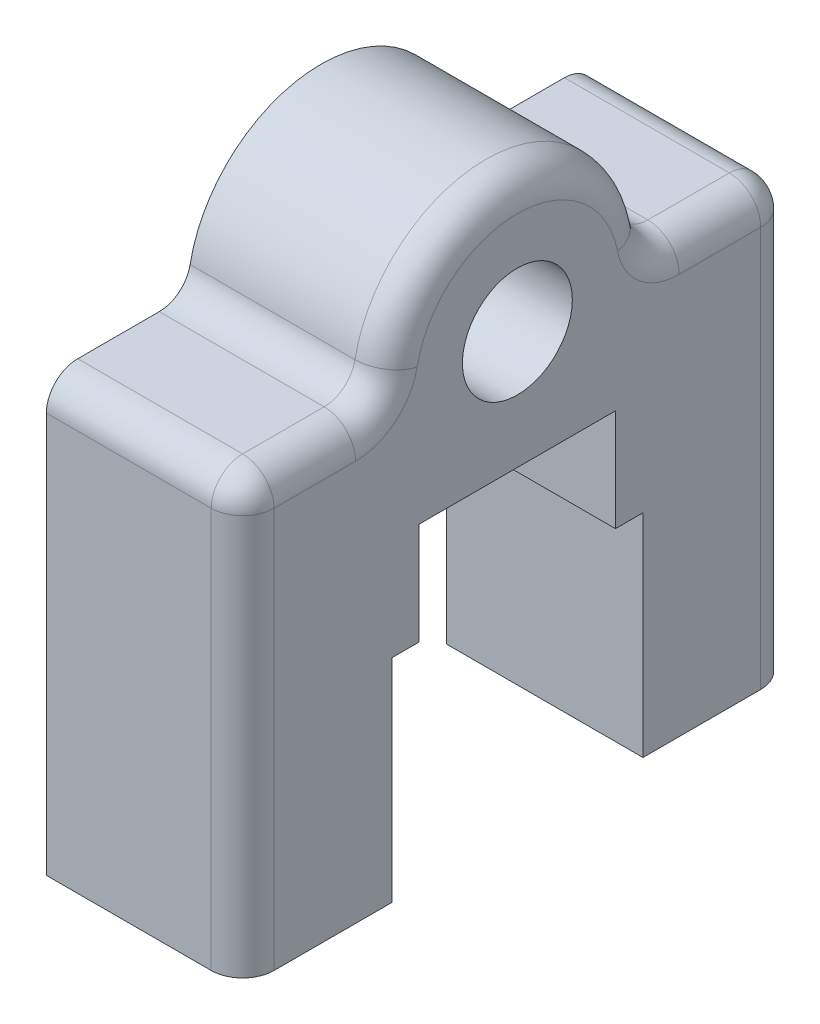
ISO-10303-21;
HEADER;
FILE_DESCRIPTION(('STEP AP214'),'2;1');
FILE_NAME('part.step','',(''),(''),'','','');
FILE_SCHEMA(('AUTOMOTIVE_DESIGN { 1 0 10303 214 1 1 1 1 }'));
ENDSEC;
DATA;
#1=APPLICATION_CONTEXT('core data for automotive mechanical design processes');
#2=APPLICATION_PROTOCOL_DEFINITION('international standard','automotive_design',2000,#1);
#3=PRODUCT_CONTEXT('',#1,'mechanical');
#4=PRODUCT('Part','Part','',(#3));
#5=PRODUCT_RELATED_PRODUCT_CATEGORY('part','',(#4));
#6=PRODUCT_DEFINITION_FORMATION('','',#4);
#7=PRODUCT_DEFINITION_CONTEXT('part definition',#1,'design');
#8=PRODUCT_DEFINITION('design','',#6,#7);
#9=PRODUCT_DEFINITION_SHAPE('','',#8);
#10=(LENGTH_UNIT() NAMED_UNIT(*) SI_UNIT(.MILLI.,.METRE.));
#11=(NAMED_UNIT(*) PLANE_ANGLE_UNIT() SI_UNIT($,.RADIAN.));
#12=(NAMED_UNIT(*) SI_UNIT($,.STERADIAN.) SOLID_ANGLE_UNIT());
#13=UNCERTAINTY_MEASURE_WITH_UNIT(LENGTH_MEASURE(1.E-05),#10,'distance_accuracy_value','');
#14=(GEOMETRIC_REPRESENTATION_CONTEXT(3) GLOBAL_UNCERTAINTY_ASSIGNED_CONTEXT((#13)) GLOBAL_UNIT_ASSIGNED_CONTEXT((#10,
#11,#12)) REPRESENTATION_CONTEXT('',''));
#15=CARTESIAN_POINT('',(0.,0.,0.));
#16=DIRECTION('',(0.,0.,1.));
#17=DIRECTION('',(1.,0.,0.));
#18=AXIS2_PLACEMENT_3D('',#15,#16,#17);
#19=CARTESIAN_POINT('',(25.,0.,35.));
#20=DIRECTION('',(0.,1.,0.));
#21=DIRECTION('',(0.,0.,1.));
#22=AXIS2_PLACEMENT_3D('',#19,#20,#21);
#23=PLANE('',#22);
#24=DIRECTION('',(0.,0.,-1.));
#25=VECTOR('',#24,1.);
#26=CARTESIAN_POINT('',(25.,0.,35.));
#27=LINE('',#26,#25);
#28=CARTESIAN_POINT('',(25.,0.,31.));
#29=VERTEX_POINT('',#28);
#30=CARTESIAN_POINT('',(25.,0.,16.));
#31=VERTEX_POINT('',#30);
#32=EDGE_CURVE('E236',#29,#31,#27,.T.);
#33=ORIENTED_EDGE('',*,*,#32,.F.);
#34=CARTESIAN_POINT('',(21.,0.,31.));
#35=DIRECTION('',(0.,1.,0.));
#36=DIRECTION('',(0.,0.,1.));
#37=AXIS2_PLACEMENT_3D('',#34,#35,#36);
#38=CIRCLE('',#37,4.);
#39=CARTESIAN_POINT('',(21.,0.,35.));
#40=VERTEX_POINT('',#39);
#41=EDGE_CURVE('E280',#29,#40,#38,.F.);
#42=ORIENTED_EDGE('',*,*,#41,.T.);
#43=DIRECTION('',(-1.,0.,0.));
#44=VECTOR('',#43,1.);
#45=CARTESIAN_POINT('',(25.,0.,35.));
#46=LINE('',#45,#44);
#47=CARTESIAN_POINT('',(0.,0.,35.));
#48=VERTEX_POINT('',#47);
#49=EDGE_CURVE('E212',#40,#48,#46,.T.);
#50=ORIENTED_EDGE('',*,*,#49,.T.);
#51=DIRECTION('',(0.,0.,-1.));
#52=VECTOR('',#51,1.);
#53=CARTESIAN_POINT('',(0.,0.,35.));
#54=LINE('',#53,#52);
#55=CARTESIAN_POINT('',(0.,0.,16.));
#56=VERTEX_POINT('',#55);
#57=EDGE_CURVE('E205',#48,#56,#54,.T.);
#58=ORIENTED_EDGE('',*,*,#57,.T.);
#59=DIRECTION('',(1.,0.,0.));
#60=VECTOR('',#59,1.);
#61=CARTESIAN_POINT('',(0.,0.,16.));
#62=LINE('',#61,#60);
#63=EDGE_CURVE('E186',#56,#31,#62,.T.);
#64=ORIENTED_EDGE('',*,*,#63,.T.);
#65=EDGE_LOOP('',(#33,#42,#50,#58,#64));
#66=FACE_BOUND('',#65,.T.);
#67=ADVANCED_FACE('F34',(#66),#23,.F.);
#68=CARTESIAN_POINT('',(25.,55.,0.));
#69=DIRECTION('',(1.,0.,0.));
#70=DIRECTION('',(0.,0.,-1.));
#71=AXIS2_PLACEMENT_3D('',#68,#69,#70);
#72=PLANE('',#71);
#73=DIRECTION('',(0.,0.,1.));
#74=VECTOR('',#73,1.);
#75=CARTESIAN_POINT('',(25.,51.,31.));
#76=LINE('',#75,#74);
#77=CARTESIAN_POINT('',(25.,51.,20.6155281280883));
#78=VERTEX_POINT('',#77);
#79=CARTESIAN_POINT('',(25.,51.,31.));
#80=VERTEX_POINT('',#79);
#81=EDGE_CURVE('E275',#78,#80,#76,.T.);
#82=ORIENTED_EDGE('',*,*,#81,.T.);
#83=DIRECTION('',(0.,-1.,0.));
#84=VECTOR('',#83,1.);
#85=CARTESIAN_POINT('',(25.,0.,31.));
#86=LINE('',#85,#84);
#87=EDGE_CURVE('E277',#80,#29,#86,.T.);
#88=ORIENTED_EDGE('',*,*,#87,.T.);
#89=ORIENTED_EDGE('',*,*,#32,.T.);
#90=DIRECTION('',(0.,-1.,0.));
#91=VECTOR('',#90,1.);
#92=CARTESIAN_POINT('',(25.,27.,16.));
#93=LINE('',#92,#91);
#94=CARTESIAN_POINT('',(25.,27.,16.));
#95=VERTEX_POINT('',#94);
#96=EDGE_CURVE('E192',#95,#31,#93,.T.);
#97=ORIENTED_EDGE('',*,*,#96,.F.);
#98=DIRECTION('',(0.,0.,1.));
#99=VECTOR('',#98,1.);
#100=CARTESIAN_POINT('',(25.,27.,16.));
#101=LINE('',#100,#99);
#102=CARTESIAN_POINT('',(25.,27.,12.5));
#103=VERTEX_POINT('',#102);
#104=EDGE_CURVE('E209',#103,#95,#101,.T.);
#105=ORIENTED_EDGE('',*,*,#104,.F.);
#106=DIRECTION('',(0.,-1.,0.));
#107=VECTOR('',#106,1.);
#108=CARTESIAN_POINT('',(25.,27.,12.5));
#109=LINE('',#108,#107);
#110=CARTESIAN_POINT('',(25.,40.,12.5));
#111=VERTEX_POINT('',#110);
#112=EDGE_CURVE('E340',#111,#103,#109,.T.);
#113=ORIENTED_EDGE('',*,*,#112,.F.);
#114=DIRECTION('',(0.,0.,1.));
#115=VECTOR('',#114,1.);
#116=CARTESIAN_POINT('',(25.,40.,12.5));
#117=LINE('',#116,#115);
#118=CARTESIAN_POINT('',(25.,40.,-12.5));
#119=VERTEX_POINT('',#118);
#120=EDGE_CURVE('E337',#119,#111,#117,.T.);
#121=ORIENTED_EDGE('',*,*,#120,.F.);
#122=DIRECTION('',(0.,1.,0.));
#123=VECTOR('',#122,1.);
#124=CARTESIAN_POINT('',(25.,27.,-12.5));
#125=LINE('',#124,#123);
#126=CARTESIAN_POINT('',(25.,27.,-12.5));
#127=VERTEX_POINT('',#126);
#128=EDGE_CURVE('E334',#127,#119,#125,.T.);
#129=ORIENTED_EDGE('',*,*,#128,.F.);
#130=DIRECTION('',(0.,0.,1.));
#131=VECTOR('',#130,1.);
#132=CARTESIAN_POINT('',(25.,27.,-12.5));
#133=LINE('',#132,#131);
#134=CARTESIAN_POINT('',(25.,27.,-16.));
#135=VERTEX_POINT('',#134);
#136=EDGE_CURVE('E327',#135,#127,#133,.T.);
#137=ORIENTED_EDGE('',*,*,#136,.F.);
#138=DIRECTION('',(0.,1.,0.));
#139=VECTOR('',#138,1.);
#140=CARTESIAN_POINT('',(25.,27.,-16.));
#141=LINE('',#140,#139);
#142=CARTESIAN_POINT('',(25.,0.,-16.));
#143=VERTEX_POINT('',#142);
#144=EDGE_CURVE('E324',#143,#135,#141,.T.);
#145=ORIENTED_EDGE('',*,*,#144,.F.);
#146=CARTESIAN_POINT('',(25.,0.,-31.));
#147=VERTEX_POINT('',#146);
#148=EDGE_CURVE('E233',#143,#147,#27,.T.);
#149=ORIENTED_EDGE('',*,*,#148,.T.);
#150=DIRECTION('',(0.,1.,0.));
#151=VECTOR('',#150,1.);
#152=CARTESIAN_POINT('',(25.,51.,-31.));
#153=LINE('',#152,#151);
#154=CARTESIAN_POINT('',(25.,51.,-31.));
#155=VERTEX_POINT('',#154);
#156=EDGE_CURVE('E265',#147,#155,#153,.T.);
#157=ORIENTED_EDGE('',*,*,#156,.T.);
#158=DIRECTION('',(0.,0.,1.));
#159=VECTOR('',#158,1.);
#160=CARTESIAN_POINT('',(25.,51.,-20.6155281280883));
#161=LINE('',#160,#159);
#162=CARTESIAN_POINT('',(25.,51.,-20.6155281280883));
#163=VERTEX_POINT('',#162);
#164=EDGE_CURVE('E267',#155,#163,#161,.T.);
#165=ORIENTED_EDGE('',*,*,#164,.T.);
#166=CARTESIAN_POINT('',(25.,59.,-20.6155281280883));
#167=DIRECTION('',(1.,0.,0.));
#168=DIRECTION('',(0.,0.,-1.));
#169=AXIS2_PLACEMENT_3D('',#166,#167,#168);
#170=CIRCLE('',#169,8.);
#171=CARTESIAN_POINT('',(25.,57.4761904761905,-12.7619936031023));
#172=VERTEX_POINT('',#171);
#173=EDGE_CURVE('E269',#163,#172,#170,.F.);
#174=ORIENTED_EDGE('',*,*,#173,.T.);
#175=CARTESIAN_POINT('',(25.,55.,0.));
#176=DIRECTION('',(1.,0.,0.));
#177=DIRECTION('',(0.,0.,-1.));
#178=AXIS2_PLACEMENT_3D('',#175,#176,#177);
#179=CIRCLE('',#178,13.);
#180=CARTESIAN_POINT('',(25.,57.4761904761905,12.7619936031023));
#181=VERTEX_POINT('',#180);
#182=EDGE_CURVE('E271',#172,#181,#179,.T.);
#183=ORIENTED_EDGE('',*,*,#182,.T.);
#184=CARTESIAN_POINT('',(25.,59.,20.6155281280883));
#185=DIRECTION('',(1.,0.,0.));
#186=DIRECTION('',(0.,0.,-1.));
#187=AXIS2_PLACEMENT_3D('',#184,#185,#186);
#188=CIRCLE('',#187,8.);
#189=EDGE_CURVE('E273',#181,#78,#188,.F.);
#190=ORIENTED_EDGE('',*,*,#189,.T.);
#191=EDGE_LOOP('',(#82,#88,#89,#97,#105,#113,#121,#129,#137,#145,#149,#157,#165,#174,#183,#190));
#192=FACE_BOUND('',#191,.T.);
#193=CARTESIAN_POINT('',(25.,55.,0.));
#194=DIRECTION('',(1.,0.,0.));
#195=DIRECTION('',(0.,0.,-1.));
#196=AXIS2_PLACEMENT_3D('',#193,#194,#195);
#197=CIRCLE('',#196,7.);
#198=CARTESIAN_POINT('',(25.,55.,-7.));
#199=VERTEX_POINT('',#198);
#200=EDGE_CURVE('E359',#199,#199,#197,.T.);
#201=ORIENTED_EDGE('',*,*,#200,.F.);
#202=EDGE_LOOP('',(#201));
#203=FACE_BOUND('',#202,.T.);
#204=ADVANCED_FACE('F368',(#192,#203),#72,.T.);
#205=CARTESIAN_POINT('',(0.,55.,0.));
#206=DIRECTION('',(1.,0.,0.));
#207=DIRECTION('',(0.,0.,-1.));
#208=AXIS2_PLACEMENT_3D('',#205,#206,#207);
#209=PLANE('',#208);
#210=DIRECTION('',(0.,0.,1.));
#211=VECTOR('',#210,1.);
#212=CARTESIAN_POINT('',(0.,55.,-17.));
#213=LINE('',#212,#211);
#214=CARTESIAN_POINT('',(0.,55.,-31.));
#215=VERTEX_POINT('',#214);
#216=CARTESIAN_POINT('',(0.,55.,-20.6155281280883));
#217=VERTEX_POINT('',#216);
#218=EDGE_CURVE('E218',#215,#217,#213,.T.);
#219=ORIENTED_EDGE('',*,*,#218,.F.);
#220=CARTESIAN_POINT('',(0.,51.,-31.));
#221=DIRECTION('',(1.,0.,0.));
#222=DIRECTION('',(0.,0.,-1.));
#223=AXIS2_PLACEMENT_3D('',#220,#221,#222);
#224=CIRCLE('',#223,4.);
#225=CARTESIAN_POINT('',(0.,51.,-35.));
#226=VERTEX_POINT('',#225);
#227=EDGE_CURVE('E245',#215,#226,#224,.F.);
#228=ORIENTED_EDGE('',*,*,#227,.T.);
#229=DIRECTION('',(0.,1.,0.));
#230=VECTOR('',#229,1.);
#231=CARTESIAN_POINT('',(0.,0.,-35.));
#232=LINE('',#231,#230);
#233=CARTESIAN_POINT('',(0.,0.,-35.));
#234=VERTEX_POINT('',#233);
#235=EDGE_CURVE('E214',#234,#226,#232,.T.);
#236=ORIENTED_EDGE('',*,*,#235,.F.);
#237=CARTESIAN_POINT('',(0.,0.,-16.));
#238=VERTEX_POINT('',#237);
#239=EDGE_CURVE('E215',#238,#234,#54,.T.);
#240=ORIENTED_EDGE('',*,*,#239,.F.);
#241=DIRECTION('',(0.,1.,0.));
#242=VECTOR('',#241,1.);
#243=CARTESIAN_POINT('',(0.,27.,-16.));
#244=LINE('',#243,#242);
#245=CARTESIAN_POINT('',(0.,27.,-16.));
#246=VERTEX_POINT('',#245);
#247=EDGE_CURVE('E208',#238,#246,#244,.T.);
#248=ORIENTED_EDGE('',*,*,#247,.T.);
#249=DIRECTION('',(0.,0.,1.));
#250=VECTOR('',#249,1.);
#251=CARTESIAN_POINT('',(0.,27.,-12.5));
#252=LINE('',#251,#250);
#253=CARTESIAN_POINT('',(0.,27.,-12.5));
#254=VERTEX_POINT('',#253);
#255=EDGE_CURVE('E513',#246,#254,#252,.T.);
#256=ORIENTED_EDGE('',*,*,#255,.T.);
#257=DIRECTION('',(0.,1.,0.));
#258=VECTOR('',#257,1.);
#259=CARTESIAN_POINT('',(0.,27.,-12.5));
#260=LINE('',#259,#258);
#261=CARTESIAN_POINT('',(0.,40.,-12.5));
#262=VERTEX_POINT('',#261);
#263=EDGE_CURVE('E516',#254,#262,#260,.T.);
#264=ORIENTED_EDGE('',*,*,#263,.T.);
#265=DIRECTION('',(0.,0.,1.));
#266=VECTOR('',#265,1.);
#267=CARTESIAN_POINT('',(0.,40.,12.5));
#268=LINE('',#267,#266);
#269=CARTESIAN_POINT('',(0.,40.,12.5));
#270=VERTEX_POINT('',#269);
#271=EDGE_CURVE('E508',#262,#270,#268,.T.);
#272=ORIENTED_EDGE('',*,*,#271,.T.);
#273=DIRECTION('',(0.,-1.,0.));
#274=VECTOR('',#273,1.);
#275=CARTESIAN_POINT('',(0.,27.,12.5));
#276=LINE('',#275,#274);
#277=CARTESIAN_POINT('',(0.,27.,12.5));
#278=VERTEX_POINT('',#277);
#279=EDGE_CURVE('E505',#270,#278,#276,.T.);
#280=ORIENTED_EDGE('',*,*,#279,.T.);
#281=DIRECTION('',(0.,0.,1.));
#282=VECTOR('',#281,1.);
#283=CARTESIAN_POINT('',(0.,27.,16.));
#284=LINE('',#283,#282);
#285=CARTESIAN_POINT('',(0.,27.,16.));
#286=VERTEX_POINT('',#285);
#287=EDGE_CURVE('E197',#278,#286,#284,.T.);
#288=ORIENTED_EDGE('',*,*,#287,.T.);
#289=DIRECTION('',(0.,-1.,0.));
#290=VECTOR('',#289,1.);
#291=CARTESIAN_POINT('',(0.,27.,16.));
#292=LINE('',#291,#290);
#293=EDGE_CURVE('E189',#286,#56,#292,.T.);
#294=ORIENTED_EDGE('',*,*,#293,.T.);
#295=ORIENTED_EDGE('',*,*,#57,.F.);
#296=DIRECTION('',(0.,-1.,0.));
#297=VECTOR('',#296,1.);
#298=CARTESIAN_POINT('',(0.,0.,35.));
#299=LINE('',#298,#297);
#300=CARTESIAN_POINT('',(0.,51.,35.));
#301=VERTEX_POINT('',#300);
#302=EDGE_CURVE('E221',#301,#48,#299,.T.);
#303=ORIENTED_EDGE('',*,*,#302,.F.);
#304=CARTESIAN_POINT('',(0.,51.,31.));
#305=DIRECTION('',(1.,0.,0.));
#306=DIRECTION('',(0.,0.,-1.));
#307=AXIS2_PLACEMENT_3D('',#304,#305,#306);
#308=CIRCLE('',#307,4.);
#309=CARTESIAN_POINT('',(0.,55.,31.));
#310=VERTEX_POINT('',#309);
#311=EDGE_CURVE('E243',#301,#310,#308,.F.);
#312=ORIENTED_EDGE('',*,*,#311,.T.);
#313=DIRECTION('',(0.,0.,1.));
#314=VECTOR('',#313,1.);
#315=CARTESIAN_POINT('',(0.,55.,35.));
#316=LINE('',#315,#314);
#317=CARTESIAN_POINT('',(0.,55.,20.6155281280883));
#318=VERTEX_POINT('',#317);
#319=EDGE_CURVE('E230',#318,#310,#316,.T.);
#320=ORIENTED_EDGE('',*,*,#319,.F.);
#321=CARTESIAN_POINT('',(0.,59.,20.6155281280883));
#322=DIRECTION('',(1.,0.,0.));
#323=DIRECTION('',(0.,0.,-1.));
#324=AXIS2_PLACEMENT_3D('',#321,#322,#323);
#325=CIRCLE('',#324,4.);
#326=CARTESIAN_POINT('',(0.,58.2380952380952,16.6887608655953));
#327=VERTEX_POINT('',#326);
#328=EDGE_CURVE('E263',#318,#327,#325,.T.);
#329=ORIENTED_EDGE('',*,*,#328,.T.);
#330=CARTESIAN_POINT('',(0.,55.,0.));
#331=DIRECTION('',(1.,0.,0.));
#332=DIRECTION('',(0.,0.,-1.));
#333=AXIS2_PLACEMENT_3D('',#330,#331,#332);
#334=CIRCLE('',#333,17.);
#335=CARTESIAN_POINT('',(0.,58.2380952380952,-16.6887608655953));
#336=VERTEX_POINT('',#335);
#337=EDGE_CURVE('E227',#336,#327,#334,.T.);
#338=ORIENTED_EDGE('',*,*,#337,.F.);
#339=CARTESIAN_POINT('',(0.,59.,-20.6155281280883));
#340=DIRECTION('',(1.,0.,0.));
#341=DIRECTION('',(0.,0.,-1.));
#342=AXIS2_PLACEMENT_3D('',#339,#340,#341);
#343=CIRCLE('',#342,4.);
#344=EDGE_CURVE('E261',#336,#217,#343,.T.);
#345=ORIENTED_EDGE('',*,*,#344,.T.);
#346=EDGE_LOOP('',(#219,#228,#236,#240,#248,#256,#264,#272,#280,#288,#294,#295,#303,#312,#320,
#329,#338,#345));
#347=FACE_BOUND('',#346,.T.);
#348=CARTESIAN_POINT('',(0.,55.,0.));
#349=DIRECTION('',(1.,0.,0.));
#350=DIRECTION('',(0.,0.,-1.));
#351=AXIS2_PLACEMENT_3D('',#348,#349,#350);
#352=CIRCLE('',#351,7.);
#353=CARTESIAN_POINT('',(0.,55.,-7.));
#354=VERTEX_POINT('',#353);
#355=EDGE_CURVE('E347',#354,#354,#352,.T.);
#356=ORIENTED_EDGE('',*,*,#355,.T.);
#357=EDGE_LOOP('',(#356));
#358=FACE_BOUND('',#357,.T.);
#359=ADVANCED_FACE('F202',(#347,#358),#209,.F.);
#360=CARTESIAN_POINT('',(25.,0.,35.));
#361=DIRECTION('',(0.,0.,-1.));
#362=DIRECTION('',(-1.,0.,0.));
#363=AXIS2_PLACEMENT_3D('',#360,#361,#362);
#364=PLANE('',#363);
#365=ORIENTED_EDGE('',*,*,#49,.F.);
#366=DIRECTION('',(0.,-1.,0.));
#367=VECTOR('',#366,1.);
#368=CARTESIAN_POINT('',(21.,51.,35.));
#369=LINE('',#368,#367);
#370=CARTESIAN_POINT('',(21.,51.,35.));
#371=VERTEX_POINT('',#370);
#372=EDGE_CURVE('E282',#40,#371,#369,.F.);
#373=ORIENTED_EDGE('',*,*,#372,.T.);
#374=DIRECTION('',(-1.,0.,0.));
#375=VECTOR('',#374,1.);
#376=CARTESIAN_POINT('',(25.,51.,35.));
#377=LINE('',#376,#375);
#378=EDGE_CURVE('E259',#371,#301,#377,.T.);
#379=ORIENTED_EDGE('',*,*,#378,.T.);
#380=ORIENTED_EDGE('',*,*,#302,.T.);
#381=EDGE_LOOP('',(#365,#373,#379,#380));
#382=FACE_BOUND('',#381,.T.);
#383=ADVANCED_FACE('F407',(#382),#364,.F.);
#384=DIRECTION('',(-1.,0.,0.));
#385=VECTOR('',#384,1.);
#386=CARTESIAN_POINT('',(25.,0.,-35.));
#387=LINE('',#386,#385);
#388=CARTESIAN_POINT('',(21.,0.,-35.));
#389=VERTEX_POINT('',#388);
#390=EDGE_CURVE('E234',#389,#234,#387,.T.);
#391=ORIENTED_EDGE('',*,*,#390,.F.);
#392=CARTESIAN_POINT('',(21.,0.,-31.));
#393=DIRECTION('',(0.,1.,0.));
#394=DIRECTION('',(0.,0.,1.));
#395=AXIS2_PLACEMENT_3D('',#392,#393,#394);
#396=CIRCLE('',#395,4.);
#397=EDGE_CURVE('E11',#389,#147,#396,.F.);
#398=ORIENTED_EDGE('',*,*,#397,.T.);
#399=ORIENTED_EDGE('',*,*,#148,.F.);
#400=DIRECTION('',(1.,0.,0.));
#401=VECTOR('',#400,1.);
#402=CARTESIAN_POINT('',(0.,0.,-16.));
#403=LINE('',#402,#401);
#404=EDGE_CURVE('E196',#238,#143,#403,.T.);
#405=ORIENTED_EDGE('',*,*,#404,.F.);
#406=ORIENTED_EDGE('',*,*,#239,.T.);
#407=EDGE_LOOP('',(#391,#398,#399,#405,#406));
#408=FACE_BOUND('',#407,.T.);
#409=ADVANCED_FACE('F431',(#408),#23,.F.);
#410=CARTESIAN_POINT('',(25.,0.,-35.));
#411=DIRECTION('',(0.,0.,1.));
#412=DIRECTION('',(1.,0.,0.));
#413=AXIS2_PLACEMENT_3D('',#410,#411,#412);
#414=PLANE('',#413);
#415=DIRECTION('',(-1.,0.,0.));
#416=VECTOR('',#415,1.);
#417=CARTESIAN_POINT('',(25.,51.,-35.));
#418=LINE('',#417,#416);
#419=CARTESIAN_POINT('',(21.,51.,-35.));
#420=VERTEX_POINT('',#419);
#421=EDGE_CURVE('E247',#226,#420,#418,.F.);
#422=ORIENTED_EDGE('',*,*,#421,.T.);
#423=DIRECTION('',(0.,1.,0.));
#424=VECTOR('',#423,1.);
#425=CARTESIAN_POINT('',(21.,0.,-35.));
#426=LINE('',#425,#424);
#427=EDGE_CURVE('E43',#420,#389,#426,.F.);
#428=ORIENTED_EDGE('',*,*,#427,.T.);
#429=ORIENTED_EDGE('',*,*,#390,.T.);
#430=ORIENTED_EDGE('',*,*,#235,.T.);
#431=EDGE_LOOP('',(#422,#428,#429,#430));
#432=FACE_BOUND('',#431,.T.);
#433=ADVANCED_FACE('F439',(#432),#414,.F.);
#434=CARTESIAN_POINT('',(25.,55.,-17.));
#435=DIRECTION('',(0.,-1.,0.));
#436=DIRECTION('',(0.,0.,-1.));
#437=AXIS2_PLACEMENT_3D('',#434,#435,#436);
#438=PLANE('',#437);
#439=DIRECTION('',(1.,0.,0.));
#440=VECTOR('',#439,1.);
#441=CARTESIAN_POINT('',(25.,55.,-20.6155281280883));
#442=LINE('',#441,#440);
#443=CARTESIAN_POINT('',(21.,55.,-20.6155281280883));
#444=VERTEX_POINT('',#443);
#445=EDGE_CURVE('E238',#217,#444,#442,.T.);
#446=ORIENTED_EDGE('',*,*,#445,.T.);
#447=DIRECTION('',(0.,0.,1.));
#448=VECTOR('',#447,1.);
#449=CARTESIAN_POINT('',(21.,55.,-31.));
#450=LINE('',#449,#448);
#451=CARTESIAN_POINT('',(21.,55.,-31.));
#452=VERTEX_POINT('',#451);
#453=EDGE_CURVE('E294',#444,#452,#450,.F.);
#454=ORIENTED_EDGE('',*,*,#453,.T.);
#455=DIRECTION('',(-1.,0.,0.));
#456=VECTOR('',#455,1.);
#457=CARTESIAN_POINT('',(25.,55.,-31.));
#458=LINE('',#457,#456);
#459=EDGE_CURVE('E241',#452,#215,#458,.T.);
#460=ORIENTED_EDGE('',*,*,#459,.T.);
#461=ORIENTED_EDGE('',*,*,#218,.T.);
#462=EDGE_LOOP('',(#446,#454,#460,#461));
#463=FACE_BOUND('',#462,.T.);
#464=ADVANCED_FACE('F444',(#463),#438,.F.);
#465=CARTESIAN_POINT('',(25.,55.,0.));
#466=DIRECTION('',(-1.,0.,0.));
#467=DIRECTION('',(0.,0.,1.));
#468=AXIS2_PLACEMENT_3D('',#465,#466,#467);
#469=CYLINDRICAL_SURFACE('',#468,17.);
#470=DIRECTION('',(-1.,0.,0.));
#471=VECTOR('',#470,1.);
#472=CARTESIAN_POINT('',(25.,58.2380952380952,16.6887608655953));
#473=LINE('',#472,#471);
#474=CARTESIAN_POINT('',(21.,58.2380952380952,16.6887608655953));
#475=VERTEX_POINT('',#474);
#476=EDGE_CURVE('E249',#327,#475,#473,.F.);
#477=ORIENTED_EDGE('',*,*,#476,.T.);
#478=CARTESIAN_POINT('',(21.,55.,0.));
#479=DIRECTION('',(1.,0.,0.));
#480=DIRECTION('',(0.,0.,-1.));
#481=AXIS2_PLACEMENT_3D('',#478,#479,#480);
#482=CIRCLE('',#481,17.);
#483=CARTESIAN_POINT('',(21.,58.2380952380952,-16.6887608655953));
#484=VERTEX_POINT('',#483);
#485=EDGE_CURVE('E290',#475,#484,#482,.F.);
#486=ORIENTED_EDGE('',*,*,#485,.T.);
#487=DIRECTION('',(-1.,0.,0.));
#488=VECTOR('',#487,1.);
#489=CARTESIAN_POINT('',(25.,58.2380952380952,-16.6887608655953));
#490=LINE('',#489,#488);
#491=EDGE_CURVE('E252',#484,#336,#490,.T.);
#492=ORIENTED_EDGE('',*,*,#491,.T.);
#493=ORIENTED_EDGE('',*,*,#337,.T.);
#494=EDGE_LOOP('',(#477,#486,#492,#493));
#495=FACE_BOUND('',#494,.T.);
#496=ADVANCED_FACE('F456',(#495),#469,.T.);
#497=CARTESIAN_POINT('',(25.,55.,35.));
#498=DIRECTION('',(0.,-1.,0.));
#499=DIRECTION('',(0.,0.,-1.));
#500=AXIS2_PLACEMENT_3D('',#497,#498,#499);
#501=PLANE('',#500);
#502=DIRECTION('',(-1.,0.,0.));
#503=VECTOR('',#502,1.);
#504=CARTESIAN_POINT('',(25.,55.,31.));
#505=LINE('',#504,#503);
#506=CARTESIAN_POINT('',(21.,55.,31.));
#507=VERTEX_POINT('',#506);
#508=EDGE_CURVE('E254',#310,#507,#505,.F.);
#509=ORIENTED_EDGE('',*,*,#508,.T.);
#510=DIRECTION('',(0.,0.,1.));
#511=VECTOR('',#510,1.);
#512=CARTESIAN_POINT('',(21.,55.,20.6155281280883));
#513=LINE('',#512,#511);
#514=CARTESIAN_POINT('',(21.,55.,20.6155281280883));
#515=VERTEX_POINT('',#514);
#516=EDGE_CURVE('E286',#507,#515,#513,.F.);
#517=ORIENTED_EDGE('',*,*,#516,.T.);
#518=DIRECTION('',(1.,0.,0.));
#519=VECTOR('',#518,1.);
#520=CARTESIAN_POINT('',(0.,55.,20.6155281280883));
#521=LINE('',#520,#519);
#522=EDGE_CURVE('E257',#515,#318,#521,.F.);
#523=ORIENTED_EDGE('',*,*,#522,.T.);
#524=ORIENTED_EDGE('',*,*,#319,.T.);
#525=EDGE_LOOP('',(#509,#517,#523,#524));
#526=FACE_BOUND('',#525,.T.);
#527=ADVANCED_FACE('F414',(#526),#501,.F.);
#528=CARTESIAN_POINT('',(25.,55.,0.));
#529=DIRECTION('',(-1.,0.,0.));
#530=DIRECTION('',(0.,0.,1.));
#531=AXIS2_PLACEMENT_3D('',#528,#529,#530);
#532=CYLINDRICAL_SURFACE('',#531,7.);
#533=ORIENTED_EDGE('',*,*,#200,.T.);
#534=EDGE_LOOP('',(#533));
#535=FACE_BOUND('',#534,.T.);
#536=ORIENTED_EDGE('',*,*,#355,.F.);
#537=EDGE_LOOP('',(#536));
#538=FACE_BOUND('',#537,.T.);
#539=ADVANCED_FACE('F464',(#535,#538),#532,.F.);
#540=CARTESIAN_POINT('',(0.,27.,16.));
#541=DIRECTION('',(0.,0.,1.));
#542=DIRECTION('',(1.,0.,0.));
#543=AXIS2_PLACEMENT_3D('',#540,#541,#542);
#544=PLANE('',#543);
#545=ORIENTED_EDGE('',*,*,#96,.T.);
#546=ORIENTED_EDGE('',*,*,#63,.F.);
#547=ORIENTED_EDGE('',*,*,#293,.F.);
#548=DIRECTION('',(1.,0.,0.));
#549=VECTOR('',#548,1.);
#550=CARTESIAN_POINT('',(0.,27.,16.));
#551=LINE('',#550,#549);
#552=EDGE_CURVE('E345',#286,#95,#551,.T.);
#553=ORIENTED_EDGE('',*,*,#552,.T.);
#554=EDGE_LOOP('',(#545,#546,#547,#553));
#555=FACE_BOUND('',#554,.T.);
#556=ADVANCED_FACE('F188',(#555),#544,.F.);
#557=CARTESIAN_POINT('',(0.,27.,16.));
#558=DIRECTION('',(0.,1.,0.));
#559=DIRECTION('',(0.,0.,1.));
#560=AXIS2_PLACEMENT_3D('',#557,#558,#559);
#561=PLANE('',#560);
#562=ORIENTED_EDGE('',*,*,#104,.T.);
#563=ORIENTED_EDGE('',*,*,#552,.F.);
#564=ORIENTED_EDGE('',*,*,#287,.F.);
#565=DIRECTION('',(1.,0.,0.));
#566=VECTOR('',#565,1.);
#567=CARTESIAN_POINT('',(0.,27.,12.5));
#568=LINE('',#567,#566);
#569=EDGE_CURVE('E348',#278,#103,#568,.T.);
#570=ORIENTED_EDGE('',*,*,#569,.T.);
#571=EDGE_LOOP('',(#562,#563,#564,#570));
#572=FACE_BOUND('',#571,.T.);
#573=ADVANCED_FACE('F475',(#572),#561,.F.);
#574=CARTESIAN_POINT('',(0.,27.,12.5));
#575=DIRECTION('',(0.,0.,1.));
#576=DIRECTION('',(1.,0.,0.));
#577=AXIS2_PLACEMENT_3D('',#574,#575,#576);
#578=PLANE('',#577);
#579=ORIENTED_EDGE('',*,*,#112,.T.);
#580=ORIENTED_EDGE('',*,*,#569,.F.);
#581=ORIENTED_EDGE('',*,*,#279,.F.);
#582=DIRECTION('',(1.,0.,0.));
#583=VECTOR('',#582,1.);
#584=CARTESIAN_POINT('',(0.,40.,12.5));
#585=LINE('',#584,#583);
#586=EDGE_CURVE('E350',#270,#111,#585,.T.);
#587=ORIENTED_EDGE('',*,*,#586,.T.);
#588=EDGE_LOOP('',(#579,#580,#581,#587));
#589=FACE_BOUND('',#588,.T.);
#590=ADVANCED_FACE('F491',(#589),#578,.F.);
#591=CARTESIAN_POINT('',(0.,40.,12.5));
#592=DIRECTION('',(0.,1.,0.));
#593=DIRECTION('',(0.,0.,1.));
#594=AXIS2_PLACEMENT_3D('',#591,#592,#593);
#595=PLANE('',#594);
#596=ORIENTED_EDGE('',*,*,#120,.T.);
#597=ORIENTED_EDGE('',*,*,#586,.F.);
#598=ORIENTED_EDGE('',*,*,#271,.F.);
#599=DIRECTION('',(1.,0.,0.));
#600=VECTOR('',#599,1.);
#601=CARTESIAN_POINT('',(0.,40.,-12.5));
#602=LINE('',#601,#600);
#603=EDGE_CURVE('E352',#262,#119,#602,.T.);
#604=ORIENTED_EDGE('',*,*,#603,.T.);
#605=EDGE_LOOP('',(#596,#597,#598,#604));
#606=FACE_BOUND('',#605,.T.);
#607=ADVANCED_FACE('F487',(#606),#595,.F.);
#608=CARTESIAN_POINT('',(0.,27.,-12.5));
#609=DIRECTION('',(0.,0.,-1.));
#610=DIRECTION('',(-1.,0.,0.));
#611=AXIS2_PLACEMENT_3D('',#608,#609,#610);
#612=PLANE('',#611);
#613=ORIENTED_EDGE('',*,*,#128,.T.);
#614=ORIENTED_EDGE('',*,*,#603,.F.);
#615=ORIENTED_EDGE('',*,*,#263,.F.);
#616=DIRECTION('',(1.,0.,0.));
#617=VECTOR('',#616,1.);
#618=CARTESIAN_POINT('',(0.,27.,-12.5));
#619=LINE('',#618,#617);
#620=EDGE_CURVE('E354',#254,#127,#619,.T.);
#621=ORIENTED_EDGE('',*,*,#620,.T.);
#622=EDGE_LOOP('',(#613,#614,#615,#621));
#623=FACE_BOUND('',#622,.T.);
#624=ADVANCED_FACE('F483',(#623),#612,.F.);
#625=CARTESIAN_POINT('',(0.,27.,-12.5));
#626=DIRECTION('',(0.,1.,0.));
#627=DIRECTION('',(0.,0.,1.));
#628=AXIS2_PLACEMENT_3D('',#625,#626,#627);
#629=PLANE('',#628);
#630=ORIENTED_EDGE('',*,*,#136,.T.);
#631=ORIENTED_EDGE('',*,*,#620,.F.);
#632=ORIENTED_EDGE('',*,*,#255,.F.);
#633=DIRECTION('',(1.,0.,0.));
#634=VECTOR('',#633,1.);
#635=CARTESIAN_POINT('',(0.,27.,-16.));
#636=LINE('',#635,#634);
#637=EDGE_CURVE('E356',#246,#135,#636,.T.);
#638=ORIENTED_EDGE('',*,*,#637,.T.);
#639=EDGE_LOOP('',(#630,#631,#632,#638));
#640=FACE_BOUND('',#639,.T.);
#641=ADVANCED_FACE('F479',(#640),#629,.F.);
#642=CARTESIAN_POINT('',(0.,27.,-16.));
#643=DIRECTION('',(0.,0.,-1.));
#644=DIRECTION('',(0.,1.,0.));
#645=AXIS2_PLACEMENT_3D('',#642,#643,#644);
#646=PLANE('',#645);
#647=ORIENTED_EDGE('',*,*,#144,.T.);
#648=ORIENTED_EDGE('',*,*,#637,.F.);
#649=ORIENTED_EDGE('',*,*,#247,.F.);
#650=ORIENTED_EDGE('',*,*,#404,.T.);
#651=EDGE_LOOP('',(#647,#648,#649,#650));
#652=FACE_BOUND('',#651,.T.);
#653=ADVANCED_FACE('F476',(#652),#646,.F.);
#654=CARTESIAN_POINT('',(25.,51.,-31.));
#655=DIRECTION('',(-1.,0.,0.));
#656=DIRECTION('',(0.,0.,1.));
#657=AXIS2_PLACEMENT_3D('',#654,#655,#656);
#658=CYLINDRICAL_SURFACE('',#657,4.);
#659=ORIENTED_EDGE('',*,*,#459,.F.);
#660=CARTESIAN_POINT('',(21.,51.,-31.));
#661=DIRECTION('',(-1.,0.,0.));
#662=DIRECTION('',(0.,0.,1.));
#663=AXIS2_PLACEMENT_3D('',#660,#661,#662);
#664=CIRCLE('',#663,4.);
#665=EDGE_CURVE('E58',#452,#420,#664,.T.);
#666=ORIENTED_EDGE('',*,*,#665,.T.);
#667=ORIENTED_EDGE('',*,*,#421,.F.);
#668=ORIENTED_EDGE('',*,*,#227,.F.);
#669=EDGE_LOOP('',(#659,#666,#667,#668));
#670=FACE_BOUND('',#669,.T.);
#671=ADVANCED_FACE('F448',(#670),#658,.T.);
#672=CARTESIAN_POINT('',(25.,59.,-20.6155281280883));
#673=DIRECTION('',(-1.,0.,0.));
#674=DIRECTION('',(0.,0.,1.));
#675=AXIS2_PLACEMENT_3D('',#672,#673,#674);
#676=CYLINDRICAL_SURFACE('',#675,4.);
#677=ORIENTED_EDGE('',*,*,#491,.F.);
#678=CARTESIAN_POINT('',(21.,59.,-20.6155281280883));
#679=DIRECTION('',(1.,0.,0.));
#680=DIRECTION('',(0.,0.,-1.));
#681=AXIS2_PLACEMENT_3D('',#678,#679,#680);
#682=CIRCLE('',#681,4.);
#683=EDGE_CURVE('E292',#484,#444,#682,.T.);
#684=ORIENTED_EDGE('',*,*,#683,.T.);
#685=ORIENTED_EDGE('',*,*,#445,.F.);
#686=ORIENTED_EDGE('',*,*,#344,.F.);
#687=EDGE_LOOP('',(#677,#684,#685,#686));
#688=FACE_BOUND('',#687,.T.);
#689=ADVANCED_FACE('F425',(#688),#676,.F.);
#690=CARTESIAN_POINT('',(25.,59.,20.6155281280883));
#691=DIRECTION('',(-1.,0.,0.));
#692=DIRECTION('',(0.,0.,1.));
#693=AXIS2_PLACEMENT_3D('',#690,#691,#692);
#694=CYLINDRICAL_SURFACE('',#693,4.);
#695=ORIENTED_EDGE('',*,*,#522,.F.);
#696=CARTESIAN_POINT('',(21.,59.,20.6155281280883));
#697=DIRECTION('',(1.,0.,0.));
#698=DIRECTION('',(0.,0.,-1.));
#699=AXIS2_PLACEMENT_3D('',#696,#697,#698);
#700=CIRCLE('',#699,4.);
#701=EDGE_CURVE('E288',#515,#475,#700,.T.);
#702=ORIENTED_EDGE('',*,*,#701,.T.);
#703=ORIENTED_EDGE('',*,*,#476,.F.);
#704=ORIENTED_EDGE('',*,*,#328,.F.);
#705=EDGE_LOOP('',(#695,#702,#703,#704));
#706=FACE_BOUND('',#705,.T.);
#707=ADVANCED_FACE('F419',(#706),#694,.F.);
#708=CARTESIAN_POINT('',(25.,51.,31.));
#709=DIRECTION('',(-1.,0.,0.));
#710=DIRECTION('',(0.,0.,1.));
#711=AXIS2_PLACEMENT_3D('',#708,#709,#710);
#712=CYLINDRICAL_SURFACE('',#711,4.);
#713=ORIENTED_EDGE('',*,*,#378,.F.);
#714=CARTESIAN_POINT('',(21.,51.,31.));
#715=DIRECTION('',(-1.,0.,0.));
#716=DIRECTION('',(0.,0.,1.));
#717=AXIS2_PLACEMENT_3D('',#714,#715,#716);
#718=CIRCLE('',#717,4.);
#719=EDGE_CURVE('E284',#371,#507,#718,.T.);
#720=ORIENTED_EDGE('',*,*,#719,.T.);
#721=ORIENTED_EDGE('',*,*,#508,.F.);
#722=ORIENTED_EDGE('',*,*,#311,.F.);
#723=EDGE_LOOP('',(#713,#720,#721,#722));
#724=FACE_BOUND('',#723,.T.);
#725=ADVANCED_FACE('F417',(#724),#712,.T.);
#726=CARTESIAN_POINT('',(21.,55.,-31.));
#727=DIRECTION('',(0.,-1.,0.));
#728=DIRECTION('',(0.,0.,-1.));
#729=AXIS2_PLACEMENT_3D('',#726,#727,#728);
#730=CYLINDRICAL_SURFACE('',#729,4.);
#731=ORIENTED_EDGE('',*,*,#397,.F.);
#732=ORIENTED_EDGE('',*,*,#427,.F.);
#733=CARTESIAN_POINT('',(21.,51.,-31.));
#734=DIRECTION('',(0.,1.,0.));
#735=DIRECTION('',(0.,0.,1.));
#736=AXIS2_PLACEMENT_3D('',#733,#734,#735);
#737=CIRCLE('',#736,4.);
#738=EDGE_CURVE('E38',#155,#420,#737,.T.);
#739=ORIENTED_EDGE('',*,*,#738,.F.);
#740=ORIENTED_EDGE('',*,*,#156,.F.);
#741=EDGE_LOOP('',(#731,#732,#739,#740));
#742=FACE_BOUND('',#741,.T.);
#743=ADVANCED_FACE('F36',(#742),#730,.T.);
#744=CARTESIAN_POINT('',(21.,51.,-31.));
#745=DIRECTION('',(0.,0.,1.));
#746=DIRECTION('',(1.,0.,0.));
#747=AXIS2_PLACEMENT_3D('',#744,#745,#746);
#748=SPHERICAL_SURFACE('',#747,4.);
#749=ORIENTED_EDGE('',*,*,#738,.T.);
#750=ORIENTED_EDGE('',*,*,#665,.F.);
#751=CARTESIAN_POINT('',(21.,51.,-31.));
#752=DIRECTION('',(0.,0.,1.));
#753=DIRECTION('',(1.,0.,0.));
#754=AXIS2_PLACEMENT_3D('',#751,#752,#753);
#755=CIRCLE('',#754,4.);
#756=EDGE_CURVE('E315',#155,#452,#755,.T.);
#757=ORIENTED_EDGE('',*,*,#756,.F.);
#758=EDGE_LOOP('',(#749,#750,#757));
#759=FACE_BOUND('',#758,.T.);
#760=ADVANCED_FACE('F375',(#759),#748,.T.);
#761=CARTESIAN_POINT('',(21.,51.,0.));
#762=DIRECTION('',(0.,0.,-1.));
#763=DIRECTION('',(0.,1.,0.));
#764=AXIS2_PLACEMENT_3D('',#761,#762,#763);
#765=CYLINDRICAL_SURFACE('',#764,4.);
#766=ORIENTED_EDGE('',*,*,#756,.T.);
#767=ORIENTED_EDGE('',*,*,#453,.F.);
#768=CARTESIAN_POINT('',(21.,51.,-20.6155281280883));
#769=DIRECTION('',(0.,0.,1.));
#770=DIRECTION('',(1.,0.,0.));
#771=AXIS2_PLACEMENT_3D('',#768,#769,#770);
#772=CIRCLE('',#771,4.);
#773=EDGE_CURVE('E313',#163,#444,#772,.T.);
#774=ORIENTED_EDGE('',*,*,#773,.F.);
#775=ORIENTED_EDGE('',*,*,#164,.F.);
#776=EDGE_LOOP('',(#766,#767,#774,#775));
#777=FACE_BOUND('',#776,.T.);
#778=ADVANCED_FACE('F377',(#777),#765,.T.);
#779=CARTESIAN_POINT('',(21.,59.,-20.6155281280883));
#780=DIRECTION('',(1.,0.,0.));
#781=DIRECTION('',(0.,0.,-1.));
#782=AXIS2_PLACEMENT_3D('',#779,#780,#781);
#783=TOROIDAL_SURFACE('',#782,8.,4.);
#784=ORIENTED_EDGE('',*,*,#773,.T.);
#785=ORIENTED_EDGE('',*,*,#683,.F.);
#786=CARTESIAN_POINT('',(21.,57.4761904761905,-12.7619936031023));
#787=DIRECTION('',(0.,0.981691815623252,0.190476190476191));
#788=DIRECTION('',(0.,-0.190476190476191,0.981691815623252));
#789=AXIS2_PLACEMENT_3D('',#786,#787,#788);
#790=CIRCLE('',#789,4.);
#791=EDGE_CURVE('E310',#172,#484,#790,.T.);
#792=ORIENTED_EDGE('',*,*,#791,.F.);
#793=ORIENTED_EDGE('',*,*,#173,.F.);
#794=EDGE_LOOP('',(#784,#785,#792,#793));
#795=FACE_BOUND('',#794,.T.);
#796=ADVANCED_FACE('F384',(#795),#783,.T.);
#797=CARTESIAN_POINT('',(21.,55.,0.));
#798=DIRECTION('',(1.,0.,0.));
#799=DIRECTION('',(0.,0.,-1.));
#800=AXIS2_PLACEMENT_3D('',#797,#798,#799);
#801=TOROIDAL_SURFACE('',#800,13.,4.);
#802=ORIENTED_EDGE('',*,*,#791,.T.);
#803=ORIENTED_EDGE('',*,*,#485,.F.);
#804=CARTESIAN_POINT('',(21.,57.4761904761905,12.7619936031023));
#805=DIRECTION('',(0.,-0.981691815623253,0.19047619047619));
#806=DIRECTION('',(0.,-0.19047619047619,-0.981691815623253));
#807=AXIS2_PLACEMENT_3D('',#804,#805,#806);
#808=CIRCLE('',#807,4.);
#809=EDGE_CURVE('E307',#181,#475,#808,.T.);
#810=ORIENTED_EDGE('',*,*,#809,.F.);
#811=ORIENTED_EDGE('',*,*,#182,.F.);
#812=EDGE_LOOP('',(#802,#803,#810,#811));
#813=FACE_BOUND('',#812,.T.);
#814=ADVANCED_FACE('F387',(#813),#801,.T.);
#815=CARTESIAN_POINT('',(21.,59.,20.6155281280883));
#816=DIRECTION('',(1.,0.,0.));
#817=DIRECTION('',(0.,0.,-1.));
#818=AXIS2_PLACEMENT_3D('',#815,#816,#817);
#819=TOROIDAL_SURFACE('',#818,8.,4.);
#820=ORIENTED_EDGE('',*,*,#809,.T.);
#821=ORIENTED_EDGE('',*,*,#701,.F.);
#822=CARTESIAN_POINT('',(21.,51.,20.6155281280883));
#823=DIRECTION('',(0.,0.,1.));
#824=DIRECTION('',(1.,0.,0.));
#825=AXIS2_PLACEMENT_3D('',#822,#823,#824);
#826=CIRCLE('',#825,4.);
#827=EDGE_CURVE('E304',#78,#515,#826,.T.);
#828=ORIENTED_EDGE('',*,*,#827,.F.);
#829=ORIENTED_EDGE('',*,*,#189,.F.);
#830=EDGE_LOOP('',(#820,#821,#828,#829));
#831=FACE_BOUND('',#830,.T.);
#832=ADVANCED_FACE('F392',(#831),#819,.T.);
#833=CARTESIAN_POINT('',(21.,51.,0.));
#834=DIRECTION('',(0.,0.,-1.));
#835=DIRECTION('',(0.,1.,0.));
#836=AXIS2_PLACEMENT_3D('',#833,#834,#835);
#837=CYLINDRICAL_SURFACE('',#836,4.);
#838=ORIENTED_EDGE('',*,*,#827,.T.);
#839=ORIENTED_EDGE('',*,*,#516,.F.);
#840=CARTESIAN_POINT('',(21.,51.,31.));
#841=DIRECTION('',(0.,0.,1.));
#842=DIRECTION('',(1.,0.,0.));
#843=AXIS2_PLACEMENT_3D('',#840,#841,#842);
#844=CIRCLE('',#843,4.);
#845=EDGE_CURVE('E301',#80,#507,#844,.T.);
#846=ORIENTED_EDGE('',*,*,#845,.F.);
#847=ORIENTED_EDGE('',*,*,#81,.F.);
#848=EDGE_LOOP('',(#838,#839,#846,#847));
#849=FACE_BOUND('',#848,.T.);
#850=ADVANCED_FACE('F399',(#849),#837,.T.);
#851=CARTESIAN_POINT('',(21.,51.,31.));
#852=DIRECTION('',(0.,0.,1.));
#853=DIRECTION('',(1.,0.,0.));
#854=AXIS2_PLACEMENT_3D('',#851,#852,#853);
#855=SPHERICAL_SURFACE('',#854,4.);
#856=ORIENTED_EDGE('',*,*,#845,.T.);
#857=ORIENTED_EDGE('',*,*,#719,.F.);
#858=CARTESIAN_POINT('',(21.,51.,31.));
#859=DIRECTION('',(0.,-1.,0.));
#860=DIRECTION('',(0.,0.,-1.));
#861=AXIS2_PLACEMENT_3D('',#858,#859,#860);
#862=CIRCLE('',#861,4.);
#863=EDGE_CURVE('E298',#80,#371,#862,.T.);
#864=ORIENTED_EDGE('',*,*,#863,.F.);
#865=EDGE_LOOP('',(#856,#857,#864));
#866=FACE_BOUND('',#865,.T.);
#867=ADVANCED_FACE('F402',(#866),#855,.T.);
#868=CARTESIAN_POINT('',(21.,55.,31.));
#869=DIRECTION('',(0.,1.,0.));
#870=DIRECTION('',(0.,0.,1.));
#871=AXIS2_PLACEMENT_3D('',#868,#869,#870);
#872=CYLINDRICAL_SURFACE('',#871,4.);
#873=ORIENTED_EDGE('',*,*,#863,.T.);
#874=ORIENTED_EDGE('',*,*,#372,.F.);
#875=ORIENTED_EDGE('',*,*,#41,.F.);
#876=ORIENTED_EDGE('',*,*,#87,.F.);
#877=EDGE_LOOP('',(#873,#874,#875,#876));
#878=FACE_BOUND('',#877,.T.);
#879=ADVANCED_FACE('F405',(#878),#872,.T.);
#880=CLOSED_SHELL('',(#67,#204,#359,#383,#409,#433,#464,#496,#527,#539,#556,#573,#590,#607,#624,
#641,#653,#671,#689,#707,#725,#743,#760,#778,#796,#814,#832,#850,#867,#879));
#881=MANIFOLD_SOLID_BREP('B2',#880);
#882=ADVANCED_BREP_SHAPE_REPRESENTATION('',(#18,#881),#14);
#883=SHAPE_DEFINITION_REPRESENTATION(#9,#882);
ENDSEC;
END-ISO-10303-21;
